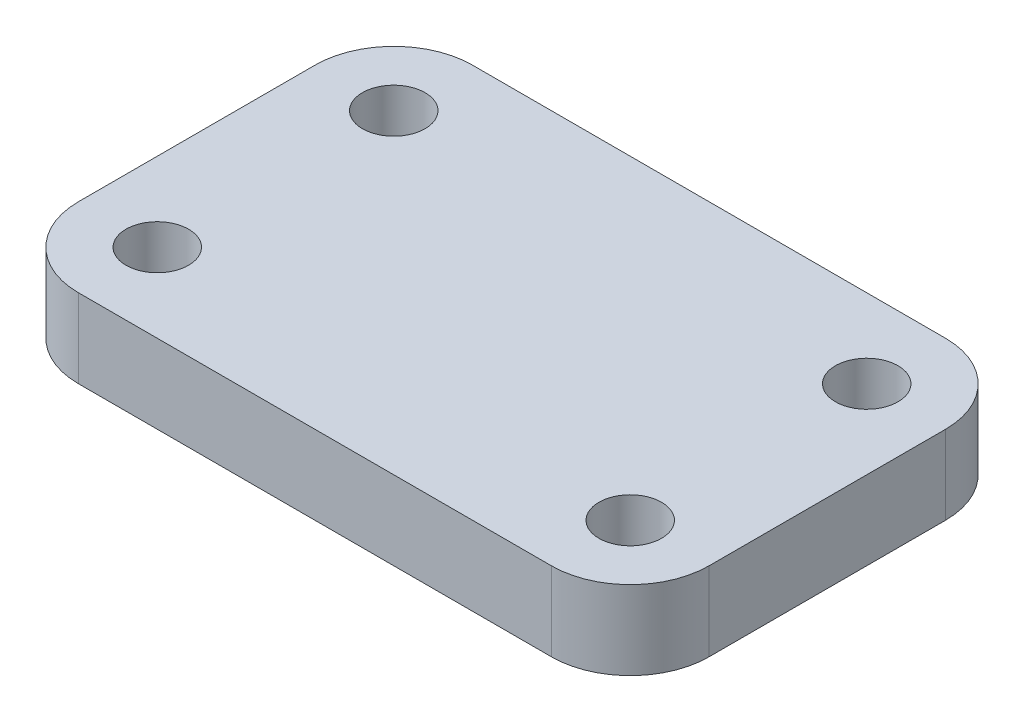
ISO-10303-21;
HEADER;
FILE_DESCRIPTION(('STEP AP214'),'2;1');
FILE_NAME('part.step','',(''),(''),'','','');
FILE_SCHEMA(('AUTOMOTIVE_DESIGN { 1 0 10303 214 1 1 1 1 }'));
ENDSEC;
DATA;
#1=APPLICATION_CONTEXT('core data for automotive mechanical design processes');
#2=APPLICATION_PROTOCOL_DEFINITION('international standard','automotive_design',2000,#1);
#3=PRODUCT_CONTEXT('',#1,'mechanical');
#4=PRODUCT('Part','Part','',(#3));
#5=PRODUCT_RELATED_PRODUCT_CATEGORY('part','',(#4));
#6=PRODUCT_DEFINITION_FORMATION('','',#4);
#7=PRODUCT_DEFINITION_CONTEXT('part definition',#1,'design');
#8=PRODUCT_DEFINITION('design','',#6,#7);
#9=PRODUCT_DEFINITION_SHAPE('','',#8);
#10=(LENGTH_UNIT() NAMED_UNIT(*) SI_UNIT(.MILLI.,.METRE.));
#11=(NAMED_UNIT(*) PLANE_ANGLE_UNIT() SI_UNIT($,.RADIAN.));
#12=(NAMED_UNIT(*) SI_UNIT($,.STERADIAN.) SOLID_ANGLE_UNIT());
#13=UNCERTAINTY_MEASURE_WITH_UNIT(LENGTH_MEASURE(1.E-05),#10,'distance_accuracy_value','');
#14=(GEOMETRIC_REPRESENTATION_CONTEXT(3) GLOBAL_UNCERTAINTY_ASSIGNED_CONTEXT((#13)) GLOBAL_UNIT_ASSIGNED_CONTEXT((#10,
#11,#12)) REPRESENTATION_CONTEXT('',''));
#15=CARTESIAN_POINT('',(0.,0.,0.));
#16=DIRECTION('',(0.,0.,1.));
#17=DIRECTION('',(1.,0.,0.));
#18=AXIS2_PLACEMENT_3D('',#15,#16,#17);
#19=CARTESIAN_POINT('',(0.,12.7,0.));
#20=DIRECTION('',(1.,0.,0.));
#21=DIRECTION('',(0.,0.,-1.));
#22=AXIS2_PLACEMENT_3D('',#19,#20,#21);
#23=PLANE('',#22);
#24=DIRECTION('',(0.,0.,1.));
#25=VECTOR('',#24,1.);
#26=CARTESIAN_POINT('',(0.,12.7,0.));
#27=LINE('',#26,#25);
#28=CARTESIAN_POINT('',(0.,12.7,-50.8));
#29=VERTEX_POINT('',#28);
#30=CARTESIAN_POINT('',(0.,12.7,-12.7));
#31=VERTEX_POINT('',#30);
#32=EDGE_CURVE('E124',#29,#31,#27,.T.);
#33=ORIENTED_EDGE('',*,*,#32,.F.);
#34=DIRECTION('',(0.,-1.,0.));
#35=VECTOR('',#34,1.);
#36=CARTESIAN_POINT('',(0.,12.7,-50.8));
#37=LINE('',#36,#35);
#38=CARTESIAN_POINT('',(0.,0.,-50.8));
#39=VERTEX_POINT('',#38);
#40=EDGE_CURVE('E11',#29,#39,#37,.T.);
#41=ORIENTED_EDGE('',*,*,#40,.T.);
#42=DIRECTION('',(0.,0.,1.));
#43=VECTOR('',#42,1.);
#44=CARTESIAN_POINT('',(0.,0.,0.));
#45=LINE('',#44,#43);
#46=CARTESIAN_POINT('',(0.,0.,-12.7));
#47=VERTEX_POINT('',#46);
#48=EDGE_CURVE('E155',#39,#47,#45,.T.);
#49=ORIENTED_EDGE('',*,*,#48,.T.);
#50=DIRECTION('',(0.,-1.,0.));
#51=VECTOR('',#50,1.);
#52=CARTESIAN_POINT('',(0.,12.7,-12.7));
#53=LINE('',#52,#51);
#54=EDGE_CURVE('E38',#47,#31,#53,.F.);
#55=ORIENTED_EDGE('',*,*,#54,.T.);
#56=EDGE_LOOP('',(#33,#41,#49,#55));
#57=FACE_BOUND('',#56,.T.);
#58=ADVANCED_FACE('F30',(#57),#23,.F.);
#59=CARTESIAN_POINT('',(0.,12.7,0.));
#60=DIRECTION('',(0.,0.,-1.));
#61=DIRECTION('',(-1.,0.,0.));
#62=AXIS2_PLACEMENT_3D('',#59,#60,#61);
#63=PLANE('',#62);
#64=DIRECTION('',(1.,0.,0.));
#65=VECTOR('',#64,1.);
#66=CARTESIAN_POINT('',(0.,0.,0.));
#67=LINE('',#66,#65);
#68=CARTESIAN_POINT('',(12.7,0.,0.));
#69=VERTEX_POINT('',#68);
#70=CARTESIAN_POINT('',(88.9,0.,0.));
#71=VERTEX_POINT('',#70);
#72=EDGE_CURVE('E129',#69,#71,#67,.T.);
#73=ORIENTED_EDGE('',*,*,#72,.T.);
#74=DIRECTION('',(0.,-1.,0.));
#75=VECTOR('',#74,1.);
#76=CARTESIAN_POINT('',(88.9,12.7,0.));
#77=LINE('',#76,#75);
#78=CARTESIAN_POINT('',(88.9,12.7,0.));
#79=VERTEX_POINT('',#78);
#80=EDGE_CURVE('E45',#71,#79,#77,.F.);
#81=ORIENTED_EDGE('',*,*,#80,.T.);
#82=DIRECTION('',(1.,0.,0.));
#83=VECTOR('',#82,1.);
#84=CARTESIAN_POINT('',(0.,12.7,0.));
#85=LINE('',#84,#83);
#86=CARTESIAN_POINT('',(12.7,12.7,0.));
#87=VERTEX_POINT('',#86);
#88=EDGE_CURVE('E127',#87,#79,#85,.T.);
#89=ORIENTED_EDGE('',*,*,#88,.F.);
#90=DIRECTION('',(0.,-1.,0.));
#91=VECTOR('',#90,1.);
#92=CARTESIAN_POINT('',(12.7,12.7,0.));
#93=LINE('',#92,#91);
#94=EDGE_CURVE('E147',#87,#69,#93,.T.);
#95=ORIENTED_EDGE('',*,*,#94,.T.);
#96=EDGE_LOOP('',(#73,#81,#89,#95));
#97=FACE_BOUND('',#96,.T.);
#98=ADVANCED_FACE('F162',(#97),#63,.F.);
#99=CARTESIAN_POINT('',(101.6,12.7,0.));
#100=DIRECTION('',(-1.,0.,0.));
#101=DIRECTION('',(0.,0.,1.));
#102=AXIS2_PLACEMENT_3D('',#99,#100,#101);
#103=PLANE('',#102);
#104=DIRECTION('',(0.,0.,-1.));
#105=VECTOR('',#104,1.);
#106=CARTESIAN_POINT('',(101.6,0.,0.));
#107=LINE('',#106,#105);
#108=CARTESIAN_POINT('',(101.6,0.,-12.7));
#109=VERTEX_POINT('',#108);
#110=CARTESIAN_POINT('',(101.6,0.,-50.8));
#111=VERTEX_POINT('',#110);
#112=EDGE_CURVE('E125',#109,#111,#107,.T.);
#113=ORIENTED_EDGE('',*,*,#112,.T.);
#114=DIRECTION('',(0.,-1.,0.));
#115=VECTOR('',#114,1.);
#116=CARTESIAN_POINT('',(101.6,12.7,-50.8));
#117=LINE('',#116,#115);
#118=CARTESIAN_POINT('',(101.6,12.7,-50.8));
#119=VERTEX_POINT('',#118);
#120=EDGE_CURVE('E102',#111,#119,#117,.F.);
#121=ORIENTED_EDGE('',*,*,#120,.T.);
#122=DIRECTION('',(0.,0.,-1.));
#123=VECTOR('',#122,1.);
#124=CARTESIAN_POINT('',(101.6,12.7,0.));
#125=LINE('',#124,#123);
#126=CARTESIAN_POINT('',(101.6,12.7,-12.7));
#127=VERTEX_POINT('',#126);
#128=EDGE_CURVE('E167',#127,#119,#125,.T.);
#129=ORIENTED_EDGE('',*,*,#128,.F.);
#130=DIRECTION('',(0.,-1.,0.));
#131=VECTOR('',#130,1.);
#132=CARTESIAN_POINT('',(101.6,12.7,-12.7));
#133=LINE('',#132,#131);
#134=EDGE_CURVE('E107',#127,#109,#133,.T.);
#135=ORIENTED_EDGE('',*,*,#134,.T.);
#136=EDGE_LOOP('',(#113,#121,#129,#135));
#137=FACE_BOUND('',#136,.T.);
#138=ADVANCED_FACE('F224',(#137),#103,.F.);
#139=CARTESIAN_POINT('',(0.,12.7,-63.5));
#140=DIRECTION('',(0.,0.,1.));
#141=DIRECTION('',(1.,0.,0.));
#142=AXIS2_PLACEMENT_3D('',#139,#140,#141);
#143=PLANE('',#142);
#144=DIRECTION('',(-1.,0.,0.));
#145=VECTOR('',#144,1.);
#146=CARTESIAN_POINT('',(0.,12.7,-63.5));
#147=LINE('',#146,#145);
#148=CARTESIAN_POINT('',(88.9,12.7,-63.5));
#149=VERTEX_POINT('',#148);
#150=CARTESIAN_POINT('',(12.7,12.7,-63.5));
#151=VERTEX_POINT('',#150);
#152=EDGE_CURVE('E117',#149,#151,#147,.T.);
#153=ORIENTED_EDGE('',*,*,#152,.F.);
#154=DIRECTION('',(0.,-1.,0.));
#155=VECTOR('',#154,1.);
#156=CARTESIAN_POINT('',(88.9,12.7,-63.5));
#157=LINE('',#156,#155);
#158=CARTESIAN_POINT('',(88.9,0.,-63.5));
#159=VERTEX_POINT('',#158);
#160=EDGE_CURVE('E101',#149,#159,#157,.T.);
#161=ORIENTED_EDGE('',*,*,#160,.T.);
#162=DIRECTION('',(-1.,0.,0.));
#163=VECTOR('',#162,1.);
#164=CARTESIAN_POINT('',(0.,0.,-63.5));
#165=LINE('',#164,#163);
#166=CARTESIAN_POINT('',(12.7,0.,-63.5));
#167=VERTEX_POINT('',#166);
#168=EDGE_CURVE('E114',#159,#167,#165,.T.);
#169=ORIENTED_EDGE('',*,*,#168,.T.);
#170=DIRECTION('',(0.,-1.,0.));
#171=VECTOR('',#170,1.);
#172=CARTESIAN_POINT('',(12.7,12.7,-63.5));
#173=LINE('',#172,#171);
#174=EDGE_CURVE('E119',#167,#151,#173,.F.);
#175=ORIENTED_EDGE('',*,*,#174,.T.);
#176=EDGE_LOOP('',(#153,#161,#169,#175));
#177=FACE_BOUND('',#176,.T.);
#178=ADVANCED_FACE('F113',(#177),#143,.F.);
#179=CARTESIAN_POINT('',(0.,12.7,-63.5));
#180=DIRECTION('',(0.,-1.,0.));
#181=DIRECTION('',(0.,0.,-1.));
#182=AXIS2_PLACEMENT_3D('',#179,#180,#181);
#183=PLANE('',#182);
#184=CARTESIAN_POINT('',(12.7,12.7,-12.7));
#185=DIRECTION('',(0.,1.,0.));
#186=DIRECTION('',(0.,0.,1.));
#187=AXIS2_PLACEMENT_3D('',#184,#185,#186);
#188=CIRCLE('',#187,5.0419);
#189=CARTESIAN_POINT('',(12.7,12.7,-7.6581));
#190=VERTEX_POINT('',#189);
#191=EDGE_CURVE('E190',#190,#190,#188,.T.);
#192=ORIENTED_EDGE('',*,*,#191,.F.);
#193=EDGE_LOOP('',(#192));
#194=FACE_BOUND('',#193,.T.);
#195=CARTESIAN_POINT('',(12.7,12.7,-50.8));
#196=DIRECTION('',(0.,1.,0.));
#197=DIRECTION('',(0.,0.,1.));
#198=AXIS2_PLACEMENT_3D('',#195,#196,#197);
#199=CIRCLE('',#198,5.0419);
#200=CARTESIAN_POINT('',(12.7,12.7,-45.7581));
#201=VERTEX_POINT('',#200);
#202=EDGE_CURVE('E184',#201,#201,#199,.T.);
#203=ORIENTED_EDGE('',*,*,#202,.F.);
#204=EDGE_LOOP('',(#203));
#205=FACE_BOUND('',#204,.T.);
#206=CARTESIAN_POINT('',(88.9,12.7,-50.8));
#207=DIRECTION('',(0.,1.,0.));
#208=DIRECTION('',(0.,0.,1.));
#209=AXIS2_PLACEMENT_3D('',#206,#207,#208);
#210=CIRCLE('',#209,5.0419);
#211=CARTESIAN_POINT('',(88.9,12.7,-45.7581));
#212=VERTEX_POINT('',#211);
#213=EDGE_CURVE('E178',#212,#212,#210,.T.);
#214=ORIENTED_EDGE('',*,*,#213,.F.);
#215=EDGE_LOOP('',(#214));
#216=FACE_BOUND('',#215,.T.);
#217=CARTESIAN_POINT('',(88.9,12.7,-12.7));
#218=DIRECTION('',(0.,1.,0.));
#219=DIRECTION('',(0.,0.,1.));
#220=AXIS2_PLACEMENT_3D('',#217,#218,#219);
#221=CIRCLE('',#220,5.0419);
#222=CARTESIAN_POINT('',(88.9,12.7,-7.6581));
#223=VERTEX_POINT('',#222);
#224=EDGE_CURVE('E172',#223,#223,#221,.T.);
#225=ORIENTED_EDGE('',*,*,#224,.F.);
#226=EDGE_LOOP('',(#225));
#227=FACE_BOUND('',#226,.T.);
#228=ORIENTED_EDGE('',*,*,#128,.T.);
#229=CARTESIAN_POINT('',(88.9,12.7,-50.8));
#230=DIRECTION('',(0.,-1.,0.));
#231=DIRECTION('',(0.,0.,-1.));
#232=AXIS2_PLACEMENT_3D('',#229,#230,#231);
#233=CIRCLE('',#232,12.7);
#234=EDGE_CURVE('E145',#119,#149,#233,.F.);
#235=ORIENTED_EDGE('',*,*,#234,.T.);
#236=ORIENTED_EDGE('',*,*,#152,.T.);
#237=CARTESIAN_POINT('',(12.7,12.7,-50.8));
#238=DIRECTION('',(0.,-1.,0.));
#239=DIRECTION('',(0.,0.,-1.));
#240=AXIS2_PLACEMENT_3D('',#237,#238,#239);
#241=CIRCLE('',#240,12.7);
#242=EDGE_CURVE('E141',#151,#29,#241,.F.);
#243=ORIENTED_EDGE('',*,*,#242,.T.);
#244=ORIENTED_EDGE('',*,*,#32,.T.);
#245=CARTESIAN_POINT('',(12.7,12.7,-12.7));
#246=DIRECTION('',(0.,-1.,0.));
#247=DIRECTION('',(0.,0.,-1.));
#248=AXIS2_PLACEMENT_3D('',#245,#246,#247);
#249=CIRCLE('',#248,12.7);
#250=EDGE_CURVE('E52',#31,#87,#249,.F.);
#251=ORIENTED_EDGE('',*,*,#250,.T.);
#252=ORIENTED_EDGE('',*,*,#88,.T.);
#253=CARTESIAN_POINT('',(88.9,12.7,-12.7));
#254=DIRECTION('',(0.,-1.,0.));
#255=DIRECTION('',(0.,0.,-1.));
#256=AXIS2_PLACEMENT_3D('',#253,#254,#255);
#257=CIRCLE('',#256,12.7);
#258=EDGE_CURVE('E143',#79,#127,#257,.F.);
#259=ORIENTED_EDGE('',*,*,#258,.T.);
#260=EDGE_LOOP('',(#228,#235,#236,#243,#244,#251,#252,#259));
#261=FACE_BOUND('',#260,.T.);
#262=ADVANCED_FACE('F158',(#194,#205,#216,#227,#261),#183,.F.);
#263=CARTESIAN_POINT('',(0.,0.,-63.5));
#264=DIRECTION('',(0.,-1.,0.));
#265=DIRECTION('',(0.,0.,-1.));
#266=AXIS2_PLACEMENT_3D('',#263,#264,#265);
#267=PLANE('',#266);
#268=CARTESIAN_POINT('',(12.7,0.,-12.7));
#269=DIRECTION('',(0.,1.,0.));
#270=DIRECTION('',(0.,0.,1.));
#271=AXIS2_PLACEMENT_3D('',#268,#269,#270);
#272=CIRCLE('',#271,5.0419);
#273=CARTESIAN_POINT('',(12.7,0.,-7.6581));
#274=VERTEX_POINT('',#273);
#275=EDGE_CURVE('E187',#274,#274,#272,.T.);
#276=ORIENTED_EDGE('',*,*,#275,.T.);
#277=EDGE_LOOP('',(#276));
#278=FACE_BOUND('',#277,.T.);
#279=CARTESIAN_POINT('',(12.7,0.,-50.8));
#280=DIRECTION('',(0.,1.,0.));
#281=DIRECTION('',(0.,0.,1.));
#282=AXIS2_PLACEMENT_3D('',#279,#280,#281);
#283=CIRCLE('',#282,5.04189999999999);
#284=CARTESIAN_POINT('',(12.7,0.,-45.7581));
#285=VERTEX_POINT('',#284);
#286=EDGE_CURVE('E181',#285,#285,#283,.T.);
#287=ORIENTED_EDGE('',*,*,#286,.T.);
#288=EDGE_LOOP('',(#287));
#289=FACE_BOUND('',#288,.T.);
#290=CARTESIAN_POINT('',(88.9,0.,-50.8));
#291=DIRECTION('',(0.,1.,0.));
#292=DIRECTION('',(0.,0.,1.));
#293=AXIS2_PLACEMENT_3D('',#290,#291,#292);
#294=CIRCLE('',#293,5.0419);
#295=CARTESIAN_POINT('',(88.9,0.,-45.7581));
#296=VERTEX_POINT('',#295);
#297=EDGE_CURVE('E175',#296,#296,#294,.T.);
#298=ORIENTED_EDGE('',*,*,#297,.T.);
#299=EDGE_LOOP('',(#298));
#300=FACE_BOUND('',#299,.T.);
#301=CARTESIAN_POINT('',(88.9,0.,-12.7));
#302=DIRECTION('',(0.,1.,0.));
#303=DIRECTION('',(0.,0.,1.));
#304=AXIS2_PLACEMENT_3D('',#301,#302,#303);
#305=CIRCLE('',#304,5.0419);
#306=CARTESIAN_POINT('',(88.9,0.,-7.6581));
#307=VERTEX_POINT('',#306);
#308=EDGE_CURVE('E163',#307,#307,#305,.T.);
#309=ORIENTED_EDGE('',*,*,#308,.T.);
#310=EDGE_LOOP('',(#309));
#311=FACE_BOUND('',#310,.T.);
#312=ORIENTED_EDGE('',*,*,#168,.F.);
#313=CARTESIAN_POINT('',(88.9,0.,-50.8));
#314=DIRECTION('',(0.,-1.,0.));
#315=DIRECTION('',(0.,0.,-1.));
#316=AXIS2_PLACEMENT_3D('',#313,#314,#315);
#317=CIRCLE('',#316,12.7);
#318=EDGE_CURVE('E97',#159,#111,#317,.T.);
#319=ORIENTED_EDGE('',*,*,#318,.T.);
#320=ORIENTED_EDGE('',*,*,#112,.F.);
#321=CARTESIAN_POINT('',(88.9,0.,-12.7));
#322=DIRECTION('',(0.,-1.,0.));
#323=DIRECTION('',(0.,0.,-1.));
#324=AXIS2_PLACEMENT_3D('',#321,#322,#323);
#325=CIRCLE('',#324,12.7);
#326=EDGE_CURVE('E108',#109,#71,#325,.T.);
#327=ORIENTED_EDGE('',*,*,#326,.T.);
#328=ORIENTED_EDGE('',*,*,#72,.F.);
#329=CARTESIAN_POINT('',(12.7,0.,-12.7));
#330=DIRECTION('',(0.,-1.,0.));
#331=DIRECTION('',(0.,0.,-1.));
#332=AXIS2_PLACEMENT_3D('',#329,#330,#331);
#333=CIRCLE('',#332,12.7);
#334=EDGE_CURVE('E118',#69,#47,#333,.T.);
#335=ORIENTED_EDGE('',*,*,#334,.T.);
#336=ORIENTED_EDGE('',*,*,#48,.F.);
#337=CARTESIAN_POINT('',(12.7,0.,-50.8));
#338=DIRECTION('',(0.,-1.,0.));
#339=DIRECTION('',(0.,0.,-1.));
#340=AXIS2_PLACEMENT_3D('',#337,#338,#339);
#341=CIRCLE('',#340,12.7);
#342=EDGE_CURVE('E123',#39,#167,#341,.T.);
#343=ORIENTED_EDGE('',*,*,#342,.T.);
#344=EDGE_LOOP('',(#312,#319,#320,#327,#328,#335,#336,#343));
#345=FACE_BOUND('',#344,.T.);
#346=ADVANCED_FACE('F121',(#278,#289,#300,#311,#345),#267,.T.);
#347=CARTESIAN_POINT('',(88.9,12.7,-50.8));
#348=DIRECTION('',(0.,-1.,0.));
#349=DIRECTION('',(0.,0.,-1.));
#350=AXIS2_PLACEMENT_3D('',#347,#348,#349);
#351=CYLINDRICAL_SURFACE('',#350,12.7);
#352=ORIENTED_EDGE('',*,*,#234,.F.);
#353=ORIENTED_EDGE('',*,*,#120,.F.);
#354=ORIENTED_EDGE('',*,*,#318,.F.);
#355=ORIENTED_EDGE('',*,*,#160,.F.);
#356=EDGE_LOOP('',(#352,#353,#354,#355));
#357=FACE_BOUND('',#356,.T.);
#358=ADVANCED_FACE('F100',(#357),#351,.T.);
#359=CARTESIAN_POINT('',(88.9,12.7,-12.7));
#360=DIRECTION('',(0.,-1.,0.));
#361=DIRECTION('',(0.,0.,-1.));
#362=AXIS2_PLACEMENT_3D('',#359,#360,#361);
#363=CYLINDRICAL_SURFACE('',#362,12.7);
#364=ORIENTED_EDGE('',*,*,#258,.F.);
#365=ORIENTED_EDGE('',*,*,#80,.F.);
#366=ORIENTED_EDGE('',*,*,#326,.F.);
#367=ORIENTED_EDGE('',*,*,#134,.F.);
#368=EDGE_LOOP('',(#364,#365,#366,#367));
#369=FACE_BOUND('',#368,.T.);
#370=ADVANCED_FACE('F230',(#369),#363,.T.);
#371=CARTESIAN_POINT('',(12.7,12.7,-50.8));
#372=DIRECTION('',(0.,-1.,0.));
#373=DIRECTION('',(0.,0.,-1.));
#374=AXIS2_PLACEMENT_3D('',#371,#372,#373);
#375=CYLINDRICAL_SURFACE('',#374,12.7);
#376=ORIENTED_EDGE('',*,*,#242,.F.);
#377=ORIENTED_EDGE('',*,*,#174,.F.);
#378=ORIENTED_EDGE('',*,*,#342,.F.);
#379=ORIENTED_EDGE('',*,*,#40,.F.);
#380=EDGE_LOOP('',(#376,#377,#378,#379));
#381=FACE_BOUND('',#380,.T.);
#382=ADVANCED_FACE('F217',(#381),#375,.T.);
#383=CARTESIAN_POINT('',(12.7,12.7,-12.7));
#384=DIRECTION('',(0.,-1.,0.));
#385=DIRECTION('',(0.,0.,-1.));
#386=AXIS2_PLACEMENT_3D('',#383,#384,#385);
#387=CYLINDRICAL_SURFACE('',#386,12.7);
#388=ORIENTED_EDGE('',*,*,#250,.F.);
#389=ORIENTED_EDGE('',*,*,#54,.F.);
#390=ORIENTED_EDGE('',*,*,#334,.F.);
#391=ORIENTED_EDGE('',*,*,#94,.F.);
#392=EDGE_LOOP('',(#388,#389,#390,#391));
#393=FACE_BOUND('',#392,.T.);
#394=ADVANCED_FACE('F32',(#393),#387,.T.);
#395=CARTESIAN_POINT('',(88.9,12.7,-12.7));
#396=DIRECTION('',(0.,1.,0.));
#397=DIRECTION('',(0.,0.,1.));
#398=AXIS2_PLACEMENT_3D('',#395,#396,#397);
#399=CYLINDRICAL_SURFACE('',#398,5.0419);
#400=ORIENTED_EDGE('',*,*,#308,.F.);
#401=EDGE_LOOP('',(#400));
#402=FACE_BOUND('',#401,.T.);
#403=ORIENTED_EDGE('',*,*,#224,.T.);
#404=EDGE_LOOP('',(#403));
#405=FACE_BOUND('',#404,.T.);
#406=ADVANCED_FACE('F205',(#402,#405),#399,.F.);
#407=CARTESIAN_POINT('',(88.9,12.7,-50.8));
#408=DIRECTION('',(0.,1.,0.));
#409=DIRECTION('',(0.,0.,1.));
#410=AXIS2_PLACEMENT_3D('',#407,#408,#409);
#411=CYLINDRICAL_SURFACE('',#410,5.0419);
#412=ORIENTED_EDGE('',*,*,#297,.F.);
#413=EDGE_LOOP('',(#412));
#414=FACE_BOUND('',#413,.T.);
#415=ORIENTED_EDGE('',*,*,#213,.T.);
#416=EDGE_LOOP('',(#415));
#417=FACE_BOUND('',#416,.T.);
#418=ADVANCED_FACE('F207',(#414,#417),#411,.F.);
#419=CARTESIAN_POINT('',(12.7,12.7,-50.8));
#420=DIRECTION('',(0.,1.,0.));
#421=DIRECTION('',(0.,0.,1.));
#422=AXIS2_PLACEMENT_3D('',#419,#420,#421);
#423=CYLINDRICAL_SURFACE('',#422,5.0419);
#424=ORIENTED_EDGE('',*,*,#286,.F.);
#425=EDGE_LOOP('',(#424));
#426=FACE_BOUND('',#425,.T.);
#427=ORIENTED_EDGE('',*,*,#202,.T.);
#428=EDGE_LOOP('',(#427));
#429=FACE_BOUND('',#428,.T.);
#430=ADVANCED_FACE('F214',(#426,#429),#423,.F.);
#431=CARTESIAN_POINT('',(12.7,12.7,-12.7));
#432=DIRECTION('',(0.,1.,0.));
#433=DIRECTION('',(0.,0.,1.));
#434=AXIS2_PLACEMENT_3D('',#431,#432,#433);
#435=CYLINDRICAL_SURFACE('',#434,5.0419);
#436=ORIENTED_EDGE('',*,*,#275,.F.);
#437=EDGE_LOOP('',(#436));
#438=FACE_BOUND('',#437,.T.);
#439=ORIENTED_EDGE('',*,*,#191,.T.);
#440=EDGE_LOOP('',(#439));
#441=FACE_BOUND('',#440,.T.);
#442=ADVANCED_FACE('F194',(#438,#441),#435,.F.);
#443=CLOSED_SHELL('',(#58,#98,#138,#178,#262,#346,#358,#370,#382,#394,#406,#418,#430,#442));
#444=MANIFOLD_SOLID_BREP('B2',#443);
#445=ADVANCED_BREP_SHAPE_REPRESENTATION('',(#18,#444),#14);
#446=SHAPE_DEFINITION_REPRESENTATION(#9,#445);
ENDSEC;
END-ISO-10303-21;
